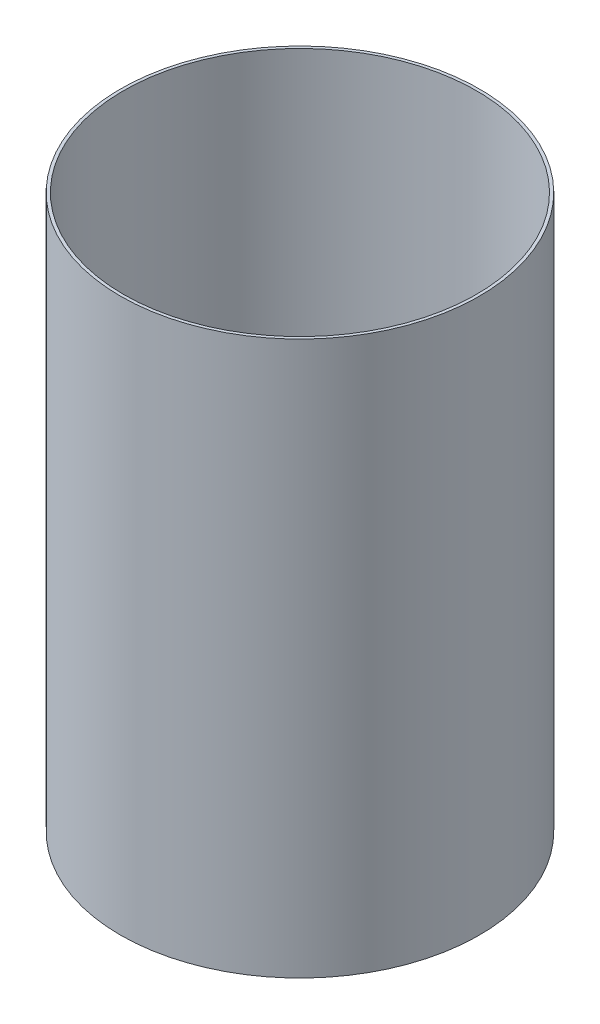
from build123d import *


with BuildPart() as part:
    # Esquisse1 → R_volution1 (revolve)
    with BuildSketch(Plane(origin=(0, 0, 0), x_dir=(0, 0, -1), z_dir=(1, 0, 0)), mode=Mode.PRIVATE) as r_volution1_sk:
        Polygon((5.9, 17), (5.9, 0), (4, 0), (4, -1.5), (6, -1.5), (6, 17), align=None)
    revolve(r_volution1_sk.sketch.rotate(Axis((0, 37.09501698, 0), (0, -1, 0)), 180), axis=Axis((0, 37.09501698, 0), (0, -1, 0)))


solid = part.part
